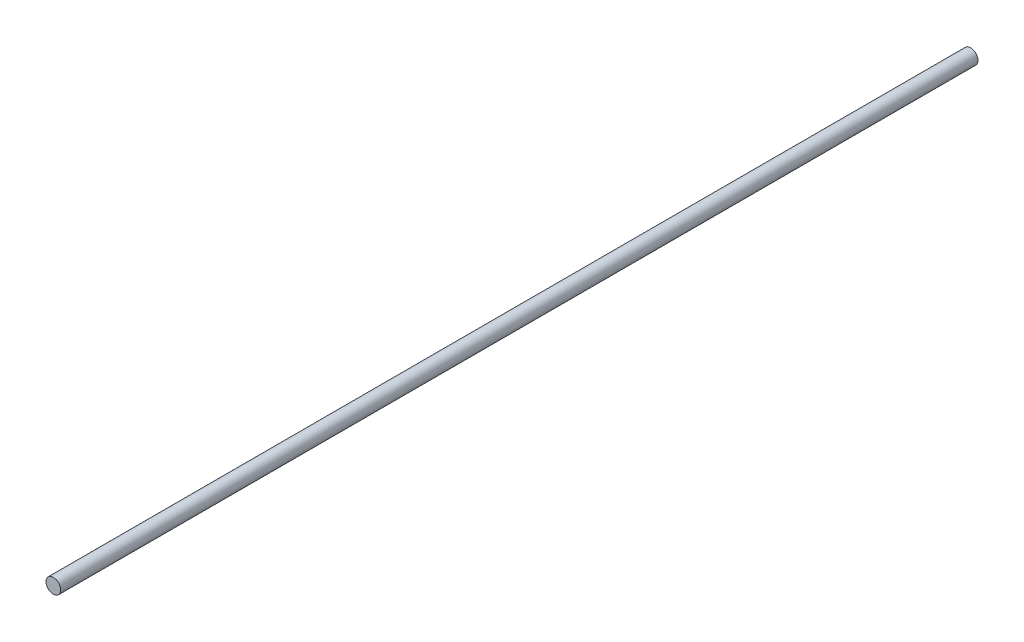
ISO-10303-21;
HEADER;
FILE_DESCRIPTION(('STEP AP214'),'2;1');
FILE_NAME('part.step','',(''),(''),'','','');
FILE_SCHEMA(('AUTOMOTIVE_DESIGN { 1 0 10303 214 1 1 1 1 }'));
ENDSEC;
DATA;
#1=APPLICATION_CONTEXT('core data for automotive mechanical design processes');
#2=APPLICATION_PROTOCOL_DEFINITION('international standard','automotive_design',2000,#1);
#3=PRODUCT_CONTEXT('',#1,'mechanical');
#4=PRODUCT('Part','Part','',(#3));
#5=PRODUCT_RELATED_PRODUCT_CATEGORY('part','',(#4));
#6=PRODUCT_DEFINITION_FORMATION('','',#4);
#7=PRODUCT_DEFINITION_CONTEXT('part definition',#1,'design');
#8=PRODUCT_DEFINITION('design','',#6,#7);
#9=PRODUCT_DEFINITION_SHAPE('','',#8);
#10=(LENGTH_UNIT() NAMED_UNIT(*) SI_UNIT(.MILLI.,.METRE.));
#11=(NAMED_UNIT(*) PLANE_ANGLE_UNIT() SI_UNIT($,.RADIAN.));
#12=(NAMED_UNIT(*) SI_UNIT($,.STERADIAN.) SOLID_ANGLE_UNIT());
#13=UNCERTAINTY_MEASURE_WITH_UNIT(LENGTH_MEASURE(1.E-05),#10,'distance_accuracy_value','');
#14=(GEOMETRIC_REPRESENTATION_CONTEXT(3) GLOBAL_UNCERTAINTY_ASSIGNED_CONTEXT((#13)) GLOBAL_UNIT_ASSIGNED_CONTEXT((#10,
#11,#12)) REPRESENTATION_CONTEXT('',''));
#15=CARTESIAN_POINT('',(0.,0.,0.));
#16=DIRECTION('',(0.,0.,1.));
#17=DIRECTION('',(1.,0.,0.));
#18=AXIS2_PLACEMENT_3D('',#15,#16,#17);
#19=CARTESIAN_POINT('',(0.,0.,-3750.));
#20=DIRECTION('',(0.,0.,1.));
#21=DIRECTION('',(1.,0.,0.));
#22=AXIS2_PLACEMENT_3D('',#19,#20,#21);
#23=CYLINDRICAL_SURFACE('',#22,30.);
#24=CARTESIAN_POINT('',(0.,0.,-3750.));
#25=DIRECTION('',(0.,0.,1.));
#26=DIRECTION('',(1.,0.,0.));
#27=AXIS2_PLACEMENT_3D('',#24,#25,#26);
#28=CIRCLE('',#27,30.);
#29=CARTESIAN_POINT('',(30.,0.,-3750.));
#30=VERTEX_POINT('',#29);
#31=EDGE_CURVE('E10',#30,#30,#28,.T.);
#32=ORIENTED_EDGE('',*,*,#31,.T.);
#33=EDGE_LOOP('',(#32));
#34=FACE_BOUND('',#33,.T.);
#35=CARTESIAN_POINT('',(0.,0.,0.));
#36=DIRECTION('',(0.,0.,1.));
#37=DIRECTION('',(1.,0.,0.));
#38=AXIS2_PLACEMENT_3D('',#35,#36,#37);
#39=CIRCLE('',#38,30.);
#40=CARTESIAN_POINT('',(30.,0.,0.));
#41=VERTEX_POINT('',#40);
#42=EDGE_CURVE('E40',#41,#41,#39,.T.);
#43=ORIENTED_EDGE('',*,*,#42,.F.);
#44=EDGE_LOOP('',(#43));
#45=FACE_BOUND('',#44,.T.);
#46=ADVANCED_FACE('F37',(#34,#45),#23,.T.);
#47=CARTESIAN_POINT('',(0.,0.,-3750.));
#48=DIRECTION('',(0.,0.,1.));
#49=DIRECTION('',(1.,0.,0.));
#50=AXIS2_PLACEMENT_3D('',#47,#48,#49);
#51=PLANE('',#50);
#52=ORIENTED_EDGE('',*,*,#31,.F.);
#53=EDGE_LOOP('',(#52));
#54=FACE_BOUND('',#53,.T.);
#55=ADVANCED_FACE('F54',(#54),#51,.F.);
#56=CARTESIAN_POINT('',(0.,0.,0.));
#57=DIRECTION('',(0.,0.,1.));
#58=DIRECTION('',(1.,0.,0.));
#59=AXIS2_PLACEMENT_3D('',#56,#57,#58);
#60=PLANE('',#59);
#61=ORIENTED_EDGE('',*,*,#42,.T.);
#62=EDGE_LOOP('',(#61));
#63=FACE_BOUND('',#62,.T.);
#64=ADVANCED_FACE('F51',(#63),#60,.T.);
#65=CLOSED_SHELL('',(#46,#55,#64));
#66=MANIFOLD_SOLID_BREP('B2',#65);
#67=ADVANCED_BREP_SHAPE_REPRESENTATION('',(#18,#66),#14);
#68=SHAPE_DEFINITION_REPRESENTATION(#9,#67);
ENDSEC;
END-ISO-10303-21;
